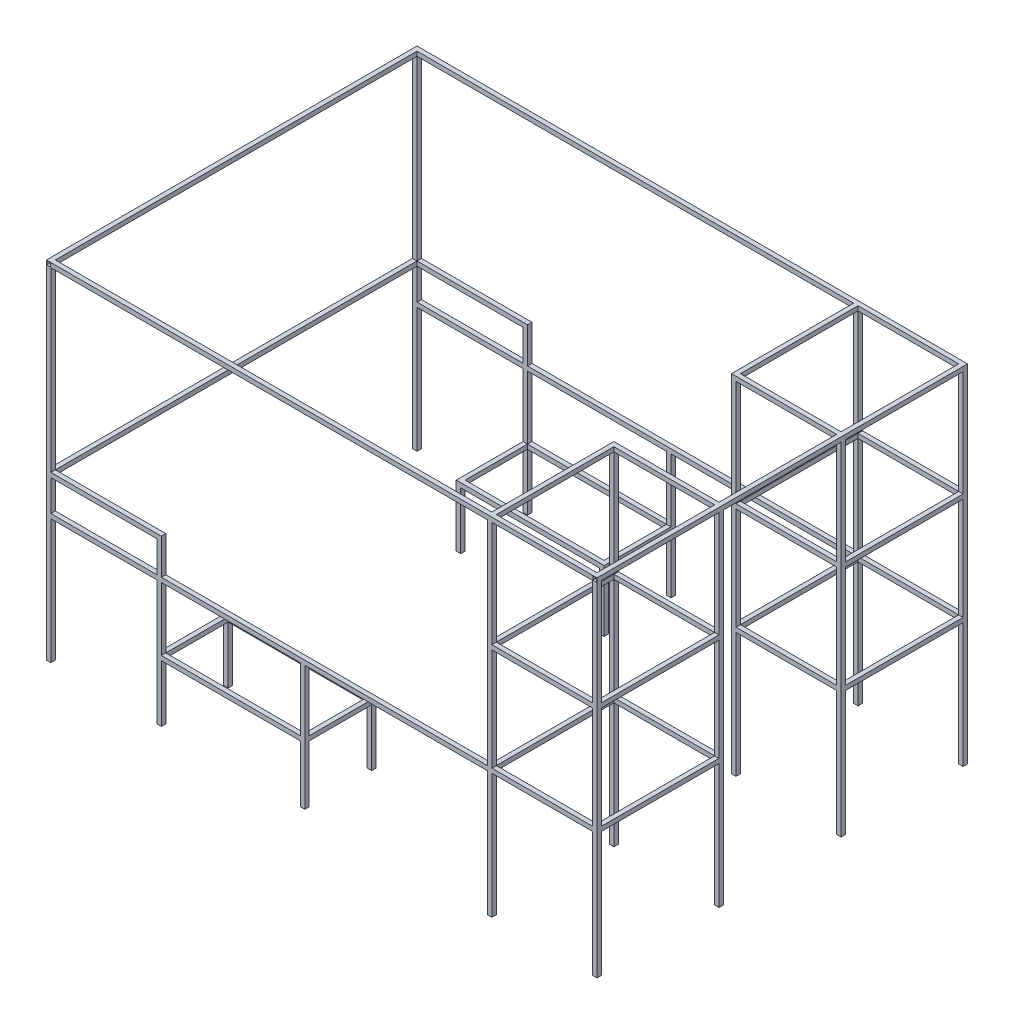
from build123d import *

# Parameters (mm, degrees)
BOSS_EXTRU_1_DEPTH      = 25
ESQUISSE2_W             = 25
ESQUISSE2_H             = 25
BOSS_EXTRU_2_DEPTH      = 2030
BOSS_EXTRU_3_DEPTH      = 25
ESQUISSE4_W             = 21
ESQUISSE4_H             = 21
ENL_V_MAT_EXTRU_1_DEPTH = 4203.085791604
ESQUISSE5_W             = 780
ESQUISSE5_H             = 355
BOSS_EXTRU_4_DEPTH      = 25
BOSS_EXTRU_5_START      = -2055
ESQUISSE6_W             = 780
ESQUISSE6_H             = 355
BOSS_EXTRU_5_DEPTH      = 25
BOSS_EXTRU_6_START      = -660
ESQUISSE7_W             = 25
ESQUISSE7_H             = 1920
BOSS_EXTRU_6_DEPTH      = 25
BOSS_EXTRU_7_START      = -1345
ESQUISSE8_W             = 25
ESQUISSE8_H             = 1920
BOSS_EXTRU_7_DEPTH      = 25
BOSS_EXTRU_8_DEPTH      = 25
ESQUISSE10_W            = 2030
ESQUISSE10_H            = 25
BOSS_EXTRU_9_DEPTH      = 25
BOSS_EXTRU_10_START     = -375
BOSS_EXTRU_10_DEPTH     = 25
BOSS_EXTRU_11_START     = -375
BOSS_EXTRU_11_DEPTH     = 25
ESQUISSE13_W            = 25
ESQUISSE13_H            = 360
BOSS_EXTRU_12_DEPTH     = 25
BOSS_EXTRU_13_START     = 700
ESQUISSE14_W            = 615
ESQUISSE14_H            = 710
ESQUISSE14_W_2          = 565
ESQUISSE14_H_2          = 660
BOSS_EXTRU_13_DEPTH     = 25
BOSS_EXTRU_14_START     = 1300
ESQUISSE15_W            = 615
ESQUISSE15_H            = 710
ESQUISSE15_W_2          = 565
ESQUISSE15_H_2          = 660
BOSS_EXTRU_14_DEPTH     = 25
ESQUISSE16_W            = 25
ESQUISSE16_H            = 1920
BOSS_EXTRU_15_DEPTH     = 25


with BuildPart() as part:
    # Esquisse1 → Boss.-Extru.1 (new body)
    with BuildSketch(Plane.XY):
        Polygon((0, 0), (0, 1945), (3090, 1945), (3090, 0), (3065, 0), (3065, 1920), (25, 1920), (25, 0), align=None)
    extrude(amount=BOSS_EXTRU_1_DEPTH)

    # Esquisse2 → Boss.-Extru.2 (add)
    with BuildSketch(Plane(origin=(0, 0, 0), x_dir=(-1, 0, 0), z_dir=(0, 0, -1))):
        with Locations((-3077.5, 1932.5)):
            Rectangle(ESQUISSE2_W, ESQUISSE2_H)
        with Locations((-12.5, 1932.5)):
            Rectangle(ESQUISSE2_W, ESQUISSE2_H)
    extrude(amount=BOSS_EXTRU_2_DEPTH)

    # Esquisse3 → Boss.-Extru.3 (add)
    with BuildSketch(Plane(origin=(0, 0, -2030), x_dir=(-1, 0, 0), z_dir=(0, 0, -1))):
        Polygon((-3090, 0), (-3090, 1945), (0, 1945), (0, 0), (-25, 0), (-25, 1920), (-3065, 1920), (-3065, 0), align=None)
    extrude(amount=BOSS_EXTRU_3_DEPTH)

    # Esquisse4 → Enl_v. mat.-Extru.1 (cut, through all)
    with BuildSketch(Plane(origin=(0, 0, -2055), x_dir=(-1, 0, 0), z_dir=(0, 0, -1))):
        with Locations((-3077.5, 1932.5)):
            Rectangle(ESQUISSE4_W, ESQUISSE4_H)
        with Locations((-12.5, 1932.5)):
            Rectangle(ESQUISSE4_W, ESQUISSE4_H)
    extrude(amount=-ENL_V_MAT_EXTRU_1_DEPTH, mode=Mode.SUBTRACT)

    # Esquisse6 → Boss.-Extru.5 (add)
    with BuildSketch(Plane.XY.offset(BOSS_EXTRU_5_START)):
        Polygon((25, 925), (645, 925), (645, 725), (2475, 725), (2475, 1920), (2500, 1920), (2500, 0), (2475, 0), (2475, 700), (1450, 700), (1450, 0), (1425, 0), (1425, 320), (645, 320), (645, 0), (620, 0), (620, 700), (25, 700), (25, 725), (620, 725), (620, 900), (25, 900), align=None)
        with Locations((1035, 522.5)):
            Rectangle(ESQUISSE6_W, ESQUISSE6_H, mode=Mode.SUBTRACT)
    extrude(amount=BOSS_EXTRU_5_DEPTH)

    # Esquisse9 → Boss.-Extru.8 (add)
    with BuildSketch(Plane(origin=(0, 1945, 0), x_dir=(1, 0, 0), z_dir=(0, 1, 0))):
        Polygon((2475, 1345), (2475, 2030), (2500, 2030), (2500, 1370), (3065, 1370), (3065, 1345), align=None)
        Polygon((2475, 685), (3065, 685), (3065, 660), (2500, 660), (2500, 0), (2475, 0), align=None)
    extrude(amount=-BOSS_EXTRU_8_DEPTH)

    # Esquisse10 → Boss.-Extru.9 (add)
    with BuildSketch(Plane.ZY):
        with Locations((-1015, 912.5)):
            Rectangle(ESQUISSE10_W, ESQUISSE10_H)
    extrude(amount=-BOSS_EXTRU_9_DEPTH)



with BuildPart() as body_2:
    # Esquisse5 → Boss.-Extru.4 (new body)
    with BuildSketch(Plane.XY):
        Polygon((620, 900), (620, 725), (25, 725), (25, 700), (620, 700), (620, 0), (645, 0), (645, 320), (1425, 320), (1425, 0), (1450, 0), (1450, 700), (2475, 700), (2475, 0), (2500, 0), (2500, 1920), (2475, 1920), (2475, 725), (645, 725), (645, 925), (25, 925), (25, 900), align=None)
        with Locations((1035, 522.5)):
            Rectangle(ESQUISSE5_W, ESQUISSE5_H, mode=Mode.SUBTRACT)
    extrude(amount=BOSS_EXTRU_4_DEPTH)


with BuildPart() as body_3:
    # Esquisse7 → Boss.-Extru.6 (new body)
    with BuildSketch(Plane.XY.offset(BOSS_EXTRU_6_START)):
        with Locations((2487.5, 960)):
            Rectangle(ESQUISSE7_W, ESQUISSE7_H)
    extrude(amount=-BOSS_EXTRU_6_DEPTH)


with BuildPart() as body_4:
    # Esquisse8 → Boss.-Extru.7 (new body)
    with BuildSketch(Plane.XY.offset(BOSS_EXTRU_7_START)):
        with Locations((2487.5, 960)):
            Rectangle(ESQUISSE8_W, ESQUISSE8_H)
    extrude(amount=-BOSS_EXTRU_7_DEPTH)


with BuildPart() as body_5:
    # Esquisse11 → Boss.-Extru.10 (new body)
    with BuildSketch(Plane.XY.offset(25).offset(BOSS_EXTRU_10_START)):
        Polygon((645, 0), (645, 320), (1425, 320), (1425, 0), (1450, 0), (1450, 345), (620, 345), (620, 0), align=None)
    extrude(amount=-BOSS_EXTRU_10_DEPTH)


with BuildPart() as body_6:
    # Esquisse12 → Boss.-Extru.11 (new body)
    with BuildSketch(Plane(origin=(0, 0, -2055), x_dir=(-1, 0, 0), z_dir=(0, 0, -1)).offset(BOSS_EXTRU_11_START)):
        Polygon((-1425, 0), (-1425, 320), (-645, 320), (-645, 0), (-620, 0), (-620, 345), (-1450, 345), (-1450, 0), align=None)
    extrude(amount=-BOSS_EXTRU_11_DEPTH)


with BuildPart() as part_1:
    add(part.part)

    add(body_2.part)  # Boss.-Extru.12 merges body 2

    add(body_5.part)  # Boss.-Extru.12 merges body 5

    add(body_6.part)  # Boss.-Extru.12 merges body 6
    # Esquisse13 → Boss.-Extru.12 (add)
    with BuildSketch(Plane(origin=(0, 345, 0), x_dir=(1, 0, 0), z_dir=(0, 1, 0))):
        with Locations((1437.5, 1860)):
            Rectangle(ESQUISSE13_W, ESQUISSE13_H)
        with Locations((632.5, 1860)):
            Rectangle(ESQUISSE13_W, ESQUISSE13_H)
        with Locations((632.5, 170)):
            Rectangle(ESQUISSE13_W, ESQUISSE13_H)
        with Locations((1437.5, 170)):
            Rectangle(ESQUISSE13_W, ESQUISSE13_H)
    extrude(amount=-BOSS_EXTRU_12_DEPTH)


    add(body_3.part)  # Boss.-Extru.13 merges body 3

    add(body_4.part)  # Boss.-Extru.13 merges body 4
    # Esquisse14 → Boss.-Extru.13 (add)
    # profile 1 of 2: a face of its own
    with BuildSketch(Plane(origin=(0, 0, 0), x_dir=(1, 0, 0), z_dir=(0, 1, 0)).offset(BOSS_EXTRU_13_START)):
        with Locations((2782.5, 1700)):
            Rectangle(ESQUISSE14_W, ESQUISSE14_H)
        with Locations((2782.5, 1700)):
            Rectangle(ESQUISSE14_W_2, ESQUISSE14_H_2, mode=Mode.SUBTRACT)
    # profile 2 of 2: a face of its own
    with BuildSketch(Plane(origin=(0, 0, 0), x_dir=(1, 0, 0), z_dir=(0, 1, 0)).offset(BOSS_EXTRU_13_START)):
        with Locations((2782.5, 330)):
            Rectangle(ESQUISSE14_W, ESQUISSE14_H)
        with Locations((2782.5, 330)):
            Rectangle(ESQUISSE14_W_2, ESQUISSE14_H_2, mode=Mode.SUBTRACT)
    extrude(amount=BOSS_EXTRU_13_DEPTH)

    # Esquisse15 → Boss.-Extru.14 (add)
    # profile 1 of 2: a face of its own
    with BuildSketch(Plane(origin=(0, 0, 0), x_dir=(1, 0, 0), z_dir=(0, 1, 0)).offset(BOSS_EXTRU_14_START)):
        with Locations((2782.5, 1700)):
            Rectangle(ESQUISSE15_W, ESQUISSE15_H)
        with Locations((2782.5, 1700)):
            Rectangle(ESQUISSE15_W_2, ESQUISSE15_H_2, mode=Mode.SUBTRACT)
    # profile 2 of 2: a face of its own
    with BuildSketch(Plane(origin=(0, 0, 0), x_dir=(1, 0, 0), z_dir=(0, 1, 0)).offset(BOSS_EXTRU_14_START)):
        with Locations((2782.5, 330)):
            Rectangle(ESQUISSE15_W, ESQUISSE15_H)
        with Locations((2782.5, 330)):
            Rectangle(ESQUISSE15_W_2, ESQUISSE15_H_2, mode=Mode.SUBTRACT)
    extrude(amount=BOSS_EXTRU_14_DEPTH)

    # Esquisse16 → Boss.-Extru.15 (add)
    with BuildSketch(Plane(origin=(3090, 0, 0), x_dir=(0, 0, -1), z_dir=(1, 0, 0))):
        with Locations((672.5, 960)):
            Rectangle(ESQUISSE16_W, ESQUISSE16_H)
        with Locations((1357.5, 960)):
            Rectangle(ESQUISSE16_W, ESQUISSE16_H)
    extrude(amount=-BOSS_EXTRU_15_DEPTH)


solid = part_1.part
